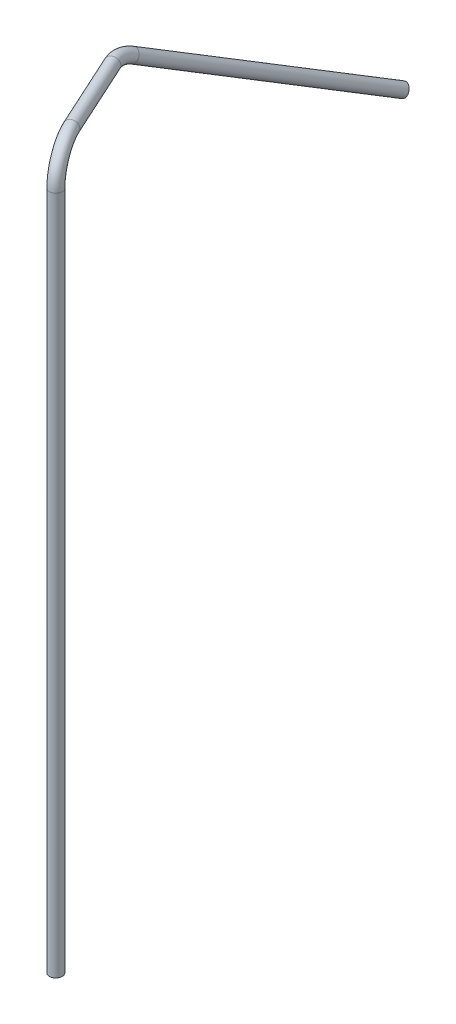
from build123d import *

# Parameters (mm, degrees)
ESQUISSE1_R = 3


with BuildPart() as part:
    # Balayage1: sweep along a curve in space
    with BuildLine() as balayage1_path:
        Line((0, -15, 0), (0, -335, 0))
        ThreePointArc((-6.236431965, 0, -13.642100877), (-1.826608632, -4.393398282, -3.995678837), (0, -15, 0))
        Line((-6.236431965, 0, -13.642100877), (-22.451155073, 0, -49.111563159))
        ThreePointArc((-23.791818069, -2.813119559, -60.161039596), (-24.04008548, -0.731105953, -54.696811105), (-22.451155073, 0, -49.111563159))
        Line((-23.791818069, -2.813119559, -60.161039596), (0.006477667, -56.692125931, -163.561686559))
    # Esquisse1 → Balayage1 (sweep)
    with BuildSketch(Plane(origin=(0, -335, 0), x_dir=(1, 0, 0), z_dir=(0, 1, 0))):
        Circle(ESQUISSE1_R)
    sweep(path=balayage1_path.line)


solid = part.part
